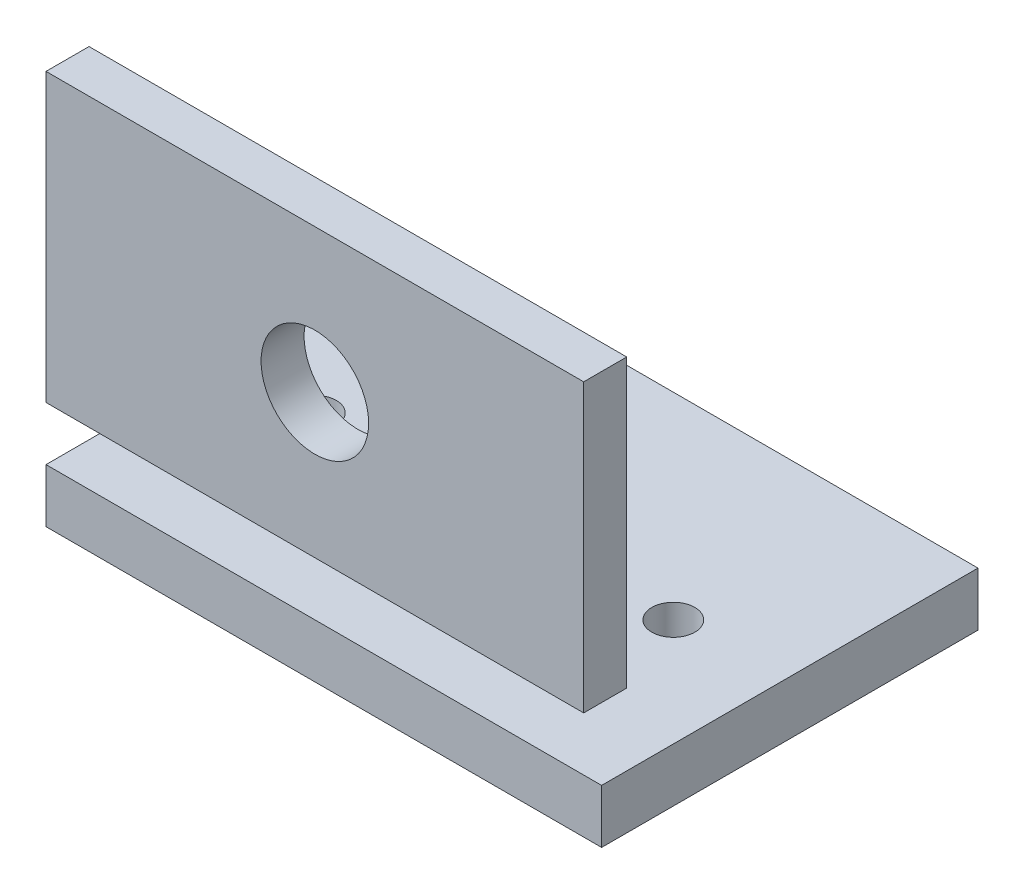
ISO-10303-21;
HEADER;
FILE_DESCRIPTION(('STEP AP214'),'2;1');
FILE_NAME('part.step','',(''),(''),'','','');
FILE_SCHEMA(('AUTOMOTIVE_DESIGN { 1 0 10303 214 1 1 1 1 }'));
ENDSEC;
DATA;
#1=APPLICATION_CONTEXT('core data for automotive mechanical design processes');
#2=APPLICATION_PROTOCOL_DEFINITION('international standard','automotive_design',2000,#1);
#3=PRODUCT_CONTEXT('',#1,'mechanical');
#4=PRODUCT('Part','Part','',(#3));
#5=PRODUCT_RELATED_PRODUCT_CATEGORY('part','',(#4));
#6=PRODUCT_DEFINITION_FORMATION('','',#4);
#7=PRODUCT_DEFINITION_CONTEXT('part definition',#1,'design');
#8=PRODUCT_DEFINITION('design','',#6,#7);
#9=PRODUCT_DEFINITION_SHAPE('','',#8);
#10=(LENGTH_UNIT() NAMED_UNIT(*) SI_UNIT(.MILLI.,.METRE.));
#11=(NAMED_UNIT(*) PLANE_ANGLE_UNIT() SI_UNIT($,.RADIAN.));
#12=(NAMED_UNIT(*) SI_UNIT($,.STERADIAN.) SOLID_ANGLE_UNIT());
#13=UNCERTAINTY_MEASURE_WITH_UNIT(LENGTH_MEASURE(1.E-05),#10,'distance_accuracy_value','');
#14=(GEOMETRIC_REPRESENTATION_CONTEXT(3) GLOBAL_UNCERTAINTY_ASSIGNED_CONTEXT((#13)) GLOBAL_UNIT_ASSIGNED_CONTEXT((#10,
#11,#12)) REPRESENTATION_CONTEXT('',''));
#15=CARTESIAN_POINT('',(0.,0.,0.));
#16=DIRECTION('',(0.,0.,1.));
#17=DIRECTION('',(1.,0.,0.));
#18=AXIS2_PLACEMENT_3D('',#15,#16,#17);
#19=CARTESIAN_POINT('',(0.,15.,-12.));
#20=DIRECTION('',(-1.,0.,0.));
#21=DIRECTION('',(0.,0.,1.));
#22=AXIS2_PLACEMENT_3D('',#19,#20,#21);
#23=PLANE('',#22);
#24=DIRECTION('',(0.,-1.,0.));
#25=VECTOR('',#24,1.);
#26=CARTESIAN_POINT('',(0.,15.,0.));
#27=LINE('',#26,#25);
#28=CARTESIAN_POINT('',(0.,95.,0.));
#29=VERTEX_POINT('',#28);
#30=CARTESIAN_POINT('',(0.,15.,0.));
#31=VERTEX_POINT('',#30);
#32=EDGE_CURVE('E118',#29,#31,#27,.T.);
#33=ORIENTED_EDGE('',*,*,#32,.F.);
#34=DIRECTION('',(0.,0.,1.));
#35=VECTOR('',#34,1.);
#36=CARTESIAN_POINT('',(0.,95.,-12.));
#37=LINE('',#36,#35);
#38=CARTESIAN_POINT('',(0.,95.,-12.));
#39=VERTEX_POINT('',#38);
#40=EDGE_CURVE('E12',#39,#29,#37,.T.);
#41=ORIENTED_EDGE('',*,*,#40,.F.);
#42=DIRECTION('',(0.,-1.,0.));
#43=VECTOR('',#42,1.);
#44=CARTESIAN_POINT('',(0.,15.,-12.));
#45=LINE('',#44,#43);
#46=CARTESIAN_POINT('',(0.,15.,-12.));
#47=VERTEX_POINT('',#46);
#48=EDGE_CURVE('E108',#39,#47,#45,.T.);
#49=ORIENTED_EDGE('',*,*,#48,.T.);
#50=DIRECTION('',(0.,0.,1.));
#51=VECTOR('',#50,1.);
#52=CARTESIAN_POINT('',(0.,15.,-12.));
#53=LINE('',#52,#51);
#54=EDGE_CURVE('E53',#47,#31,#53,.T.);
#55=ORIENTED_EDGE('',*,*,#54,.T.);
#56=EDGE_LOOP('',(#33,#41,#49,#55));
#57=FACE_BOUND('',#56,.T.);
#58=ADVANCED_FACE('F51',(#57),#23,.T.);
#59=CARTESIAN_POINT('',(0.,95.,-12.));
#60=DIRECTION('',(0.,1.,0.));
#61=DIRECTION('',(0.,0.,1.));
#62=AXIS2_PLACEMENT_3D('',#59,#60,#61);
#63=PLANE('',#62);
#64=DIRECTION('',(-1.,0.,0.));
#65=VECTOR('',#64,1.);
#66=CARTESIAN_POINT('',(0.,95.,0.));
#67=LINE('',#66,#65);
#68=CARTESIAN_POINT('',(150.,95.,0.));
#69=VERTEX_POINT('',#68);
#70=EDGE_CURVE('E112',#69,#29,#67,.T.);
#71=ORIENTED_EDGE('',*,*,#70,.F.);
#72=DIRECTION('',(0.,0.,1.));
#73=VECTOR('',#72,1.);
#74=CARTESIAN_POINT('',(150.,95.,-12.));
#75=LINE('',#74,#73);
#76=CARTESIAN_POINT('',(150.,95.,-12.));
#77=VERTEX_POINT('',#76);
#78=EDGE_CURVE('E58',#77,#69,#75,.T.);
#79=ORIENTED_EDGE('',*,*,#78,.F.);
#80=DIRECTION('',(-1.,0.,0.));
#81=VECTOR('',#80,1.);
#82=CARTESIAN_POINT('',(0.,95.,-12.));
#83=LINE('',#82,#81);
#84=EDGE_CURVE('E106',#77,#39,#83,.T.);
#85=ORIENTED_EDGE('',*,*,#84,.T.);
#86=ORIENTED_EDGE('',*,*,#40,.T.);
#87=EDGE_LOOP('',(#71,#79,#85,#86));
#88=FACE_BOUND('',#87,.T.);
#89=ADVANCED_FACE('F130',(#88),#63,.T.);
#90=CARTESIAN_POINT('',(150.,15.,-12.));
#91=DIRECTION('',(1.,0.,0.));
#92=DIRECTION('',(0.,0.,-1.));
#93=AXIS2_PLACEMENT_3D('',#90,#91,#92);
#94=PLANE('',#93);
#95=DIRECTION('',(0.,1.,0.));
#96=VECTOR('',#95,1.);
#97=CARTESIAN_POINT('',(150.,15.,0.));
#98=LINE('',#97,#96);
#99=CARTESIAN_POINT('',(150.,15.,0.));
#100=VERTEX_POINT('',#99);
#101=EDGE_CURVE('E101',#100,#69,#98,.T.);
#102=ORIENTED_EDGE('',*,*,#101,.F.);
#103=DIRECTION('',(0.,0.,1.));
#104=VECTOR('',#103,1.);
#105=CARTESIAN_POINT('',(150.,15.,-12.));
#106=LINE('',#105,#104);
#107=CARTESIAN_POINT('',(150.,15.,-12.));
#108=VERTEX_POINT('',#107);
#109=EDGE_CURVE('E96',#108,#100,#106,.T.);
#110=ORIENTED_EDGE('',*,*,#109,.F.);
#111=DIRECTION('',(0.,1.,0.));
#112=VECTOR('',#111,1.);
#113=CARTESIAN_POINT('',(150.,15.,-12.));
#114=LINE('',#113,#112);
#115=EDGE_CURVE('E97',#108,#77,#114,.T.);
#116=ORIENTED_EDGE('',*,*,#115,.T.);
#117=ORIENTED_EDGE('',*,*,#78,.T.);
#118=EDGE_LOOP('',(#102,#110,#116,#117));
#119=FACE_BOUND('',#118,.T.);
#120=ADVANCED_FACE('F98',(#119),#94,.T.);
#121=CARTESIAN_POINT('',(0.,15.,-12.));
#122=DIRECTION('',(0.,-1.,0.));
#123=DIRECTION('',(0.,0.,-1.));
#124=AXIS2_PLACEMENT_3D('',#121,#122,#123);
#125=PLANE('',#124);
#126=DIRECTION('',(1.,0.,0.));
#127=VECTOR('',#126,1.);
#128=CARTESIAN_POINT('',(0.,15.,0.));
#129=LINE('',#128,#127);
#130=EDGE_CURVE('E119',#31,#100,#129,.T.);
#131=ORIENTED_EDGE('',*,*,#130,.F.);
#132=ORIENTED_EDGE('',*,*,#54,.F.);
#133=DIRECTION('',(1.,0.,0.));
#134=VECTOR('',#133,1.);
#135=CARTESIAN_POINT('',(0.,15.,-12.));
#136=LINE('',#135,#134);
#137=EDGE_CURVE('E104',#47,#108,#136,.T.);
#138=ORIENTED_EDGE('',*,*,#137,.T.);
#139=ORIENTED_EDGE('',*,*,#109,.T.);
#140=EDGE_LOOP('',(#131,#132,#138,#139));
#141=FACE_BOUND('',#140,.T.);
#142=ADVANCED_FACE('F107',(#141),#125,.T.);
#143=CARTESIAN_POINT('',(0.,0.,-12.));
#144=DIRECTION('',(0.,0.,-1.));
#145=DIRECTION('',(-1.,0.,0.));
#146=AXIS2_PLACEMENT_3D('',#143,#144,#145);
#147=PLANE('',#146);
#148=CARTESIAN_POINT('',(75.,55.,-12.));
#149=DIRECTION('',(0.,0.,1.));
#150=DIRECTION('',(1.,0.,0.));
#151=AXIS2_PLACEMENT_3D('',#148,#149,#150);
#152=CIRCLE('',#151,15.);
#153=CARTESIAN_POINT('',(90.,55.,-12.));
#154=VERTEX_POINT('',#153);
#155=EDGE_CURVE('E117',#154,#154,#152,.T.);
#156=ORIENTED_EDGE('',*,*,#155,.T.);
#157=EDGE_LOOP('',(#156));
#158=FACE_BOUND('',#157,.T.);
#159=ORIENTED_EDGE('',*,*,#48,.F.);
#160=ORIENTED_EDGE('',*,*,#84,.F.);
#161=ORIENTED_EDGE('',*,*,#115,.F.);
#162=ORIENTED_EDGE('',*,*,#137,.F.);
#163=EDGE_LOOP('',(#159,#160,#161,#162));
#164=FACE_BOUND('',#163,.T.);
#165=ADVANCED_FACE('F102',(#158,#164),#147,.T.);
#166=CARTESIAN_POINT('',(0.,0.,0.));
#167=DIRECTION('',(0.,0.,-1.));
#168=DIRECTION('',(-1.,0.,0.));
#169=AXIS2_PLACEMENT_3D('',#166,#167,#168);
#170=PLANE('',#169);
#171=CARTESIAN_POINT('',(75.,55.,0.));
#172=DIRECTION('',(0.,0.,1.));
#173=DIRECTION('',(1.,0.,0.));
#174=AXIS2_PLACEMENT_3D('',#171,#172,#173);
#175=CIRCLE('',#174,15.);
#176=CARTESIAN_POINT('',(90.,55.,0.));
#177=VERTEX_POINT('',#176);
#178=EDGE_CURVE('E160',#177,#177,#175,.T.);
#179=ORIENTED_EDGE('',*,*,#178,.F.);
#180=EDGE_LOOP('',(#179));
#181=FACE_BOUND('',#180,.T.);
#182=ORIENTED_EDGE('',*,*,#32,.T.);
#183=ORIENTED_EDGE('',*,*,#130,.T.);
#184=ORIENTED_EDGE('',*,*,#101,.T.);
#185=ORIENTED_EDGE('',*,*,#70,.T.);
#186=EDGE_LOOP('',(#182,#183,#184,#185));
#187=FACE_BOUND('',#186,.T.);
#188=ADVANCED_FACE('F127',(#181,#187),#170,.F.);
#189=CARTESIAN_POINT('',(75.,55.,-12.));
#190=DIRECTION('',(0.,0.,1.));
#191=DIRECTION('',(1.,0.,0.));
#192=AXIS2_PLACEMENT_3D('',#189,#190,#191);
#193=CYLINDRICAL_SURFACE('',#192,15.);
#194=ORIENTED_EDGE('',*,*,#155,.F.);
#195=EDGE_LOOP('',(#194));
#196=FACE_BOUND('',#195,.T.);
#197=ORIENTED_EDGE('',*,*,#178,.T.);
#198=EDGE_LOOP('',(#197));
#199=FACE_BOUND('',#198,.T.);
#200=ADVANCED_FACE('F144',(#196,#199),#193,.F.);
#201=CLOSED_SHELL('',(#58,#89,#120,#142,#165,#188,#200));
#202=MANIFOLD_SOLID_BREP('B2',#201);
#203=CARTESIAN_POINT('',(0.,-15.,0.));
#204=DIRECTION('',(-1.,0.,0.));
#205=DIRECTION('',(0.,0.,1.));
#206=AXIS2_PLACEMENT_3D('',#203,#204,#205);
#207=PLANE('',#206);
#208=DIRECTION('',(0.,0.,1.));
#209=VECTOR('',#208,1.);
#210=CARTESIAN_POINT('',(0.,0.,0.));
#211=LINE('',#210,#209);
#212=CARTESIAN_POINT('',(0.,0.,-105.));
#213=VERTEX_POINT('',#212);
#214=CARTESIAN_POINT('',(0.,0.,0.));
#215=VERTEX_POINT('',#214);
#216=EDGE_CURVE('E261',#213,#215,#211,.T.);
#217=ORIENTED_EDGE('',*,*,#216,.F.);
#218=DIRECTION('',(0.,1.,0.));
#219=VECTOR('',#218,1.);
#220=CARTESIAN_POINT('',(0.,-15.,-105.));
#221=LINE('',#220,#219);
#222=CARTESIAN_POINT('',(0.,-15.,-105.));
#223=VERTEX_POINT('',#222);
#224=EDGE_CURVE('E47',#223,#213,#221,.T.);
#225=ORIENTED_EDGE('',*,*,#224,.F.);
#226=DIRECTION('',(0.,0.,1.));
#227=VECTOR('',#226,1.);
#228=CARTESIAN_POINT('',(0.,-15.,0.));
#229=LINE('',#228,#227);
#230=CARTESIAN_POINT('',(0.,-15.,0.));
#231=VERTEX_POINT('',#230);
#232=EDGE_CURVE('E255',#223,#231,#229,.T.);
#233=ORIENTED_EDGE('',*,*,#232,.T.);
#234=DIRECTION('',(0.,1.,0.));
#235=VECTOR('',#234,1.);
#236=CARTESIAN_POINT('',(0.,-15.,0.));
#237=LINE('',#236,#235);
#238=EDGE_CURVE('E200',#231,#215,#237,.T.);
#239=ORIENTED_EDGE('',*,*,#238,.T.);
#240=EDGE_LOOP('',(#217,#225,#233,#239));
#241=FACE_BOUND('',#240,.T.);
#242=ADVANCED_FACE('F198',(#241),#207,.T.);
#243=CARTESIAN_POINT('',(0.,-15.,-105.));
#244=DIRECTION('',(0.,0.,-1.));
#245=DIRECTION('',(-1.,0.,0.));
#246=AXIS2_PLACEMENT_3D('',#243,#244,#245);
#247=PLANE('',#246);
#248=DIRECTION('',(-1.,0.,0.));
#249=VECTOR('',#248,1.);
#250=CARTESIAN_POINT('',(0.,0.,-105.));
#251=LINE('',#250,#249);
#252=CARTESIAN_POINT('',(155.,0.,-105.));
#253=VERTEX_POINT('',#252);
#254=EDGE_CURVE('E258',#253,#213,#251,.T.);
#255=ORIENTED_EDGE('',*,*,#254,.F.);
#256=DIRECTION('',(0.,1.,0.));
#257=VECTOR('',#256,1.);
#258=CARTESIAN_POINT('',(155.,-15.,-105.));
#259=LINE('',#258,#257);
#260=CARTESIAN_POINT('',(155.,-15.,-105.));
#261=VERTEX_POINT('',#260);
#262=EDGE_CURVE('E202',#261,#253,#259,.T.);
#263=ORIENTED_EDGE('',*,*,#262,.F.);
#264=DIRECTION('',(-1.,0.,0.));
#265=VECTOR('',#264,1.);
#266=CARTESIAN_POINT('',(0.,-15.,-105.));
#267=LINE('',#266,#265);
#268=EDGE_CURVE('E253',#261,#223,#267,.T.);
#269=ORIENTED_EDGE('',*,*,#268,.T.);
#270=ORIENTED_EDGE('',*,*,#224,.T.);
#271=EDGE_LOOP('',(#255,#263,#269,#270));
#272=FACE_BOUND('',#271,.T.);
#273=ADVANCED_FACE('F275',(#272),#247,.T.);
#274=CARTESIAN_POINT('',(155.,-15.,0.));
#275=DIRECTION('',(1.,0.,0.));
#276=DIRECTION('',(0.,0.,-1.));
#277=AXIS2_PLACEMENT_3D('',#274,#275,#276);
#278=PLANE('',#277);
#279=DIRECTION('',(0.,0.,-1.));
#280=VECTOR('',#279,1.);
#281=CARTESIAN_POINT('',(155.,0.,0.));
#282=LINE('',#281,#280);
#283=CARTESIAN_POINT('',(155.,0.,0.));
#284=VERTEX_POINT('',#283);
#285=EDGE_CURVE('E247',#284,#253,#282,.T.);
#286=ORIENTED_EDGE('',*,*,#285,.F.);
#287=DIRECTION('',(0.,1.,0.));
#288=VECTOR('',#287,1.);
#289=CARTESIAN_POINT('',(155.,-15.,0.));
#290=LINE('',#289,#288);
#291=CARTESIAN_POINT('',(155.,-15.,0.));
#292=VERTEX_POINT('',#291);
#293=EDGE_CURVE('E243',#292,#284,#290,.T.);
#294=ORIENTED_EDGE('',*,*,#293,.F.);
#295=DIRECTION('',(0.,0.,-1.));
#296=VECTOR('',#295,1.);
#297=CARTESIAN_POINT('',(155.,-15.,0.));
#298=LINE('',#297,#296);
#299=EDGE_CURVE('E244',#292,#261,#298,.T.);
#300=ORIENTED_EDGE('',*,*,#299,.T.);
#301=ORIENTED_EDGE('',*,*,#262,.T.);
#302=EDGE_LOOP('',(#286,#294,#300,#301));
#303=FACE_BOUND('',#302,.T.);
#304=ADVANCED_FACE('F241',(#303),#278,.T.);
#305=CARTESIAN_POINT('',(0.,-15.,0.));
#306=DIRECTION('',(0.,0.,1.));
#307=DIRECTION('',(1.,0.,0.));
#308=AXIS2_PLACEMENT_3D('',#305,#306,#307);
#309=PLANE('',#308);
#310=DIRECTION('',(1.,0.,0.));
#311=VECTOR('',#310,1.);
#312=CARTESIAN_POINT('',(0.,0.,0.));
#313=LINE('',#312,#311);
#314=EDGE_CURVE('E262',#215,#284,#313,.T.);
#315=ORIENTED_EDGE('',*,*,#314,.F.);
#316=ORIENTED_EDGE('',*,*,#238,.F.);
#317=DIRECTION('',(1.,0.,0.));
#318=VECTOR('',#317,1.);
#319=CARTESIAN_POINT('',(0.,-15.,0.));
#320=LINE('',#319,#318);
#321=EDGE_CURVE('E246',#231,#292,#320,.T.);
#322=ORIENTED_EDGE('',*,*,#321,.T.);
#323=ORIENTED_EDGE('',*,*,#293,.T.);
#324=EDGE_LOOP('',(#315,#316,#322,#323));
#325=FACE_BOUND('',#324,.T.);
#326=ADVANCED_FACE('F251',(#325),#309,.T.);
#327=CARTESIAN_POINT('',(0.,-15.,0.));
#328=DIRECTION('',(0.,-1.,0.));
#329=DIRECTION('',(0.,0.,-1.));
#330=AXIS2_PLACEMENT_3D('',#327,#328,#329);
#331=PLANE('',#330);
#332=CARTESIAN_POINT('',(25.,-15.,-50.));
#333=DIRECTION('',(0.,1.,0.));
#334=DIRECTION('',(0.,0.,1.));
#335=AXIS2_PLACEMENT_3D('',#332,#333,#334);
#336=CIRCLE('',#335,6.);
#337=CARTESIAN_POINT('',(25.,-15.,-44.));
#338=VERTEX_POINT('',#337);
#339=EDGE_CURVE('E264',#338,#338,#336,.T.);
#340=ORIENTED_EDGE('',*,*,#339,.T.);
#341=EDGE_LOOP('',(#340));
#342=FACE_BOUND('',#341,.T.);
#343=CARTESIAN_POINT('',(125.,-15.,-50.));
#344=DIRECTION('',(0.,1.,0.));
#345=DIRECTION('',(0.,0.,1.));
#346=AXIS2_PLACEMENT_3D('',#343,#344,#345);
#347=CIRCLE('',#346,6.00000000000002);
#348=CARTESIAN_POINT('',(125.,-15.,-44.));
#349=VERTEX_POINT('',#348);
#350=EDGE_CURVE('E315',#349,#349,#347,.T.);
#351=ORIENTED_EDGE('',*,*,#350,.T.);
#352=EDGE_LOOP('',(#351));
#353=FACE_BOUND('',#352,.T.);
#354=ORIENTED_EDGE('',*,*,#232,.F.);
#355=ORIENTED_EDGE('',*,*,#268,.F.);
#356=ORIENTED_EDGE('',*,*,#299,.F.);
#357=ORIENTED_EDGE('',*,*,#321,.F.);
#358=EDGE_LOOP('',(#354,#355,#356,#357));
#359=FACE_BOUND('',#358,.T.);
#360=ADVANCED_FACE('F249',(#342,#353,#359),#331,.T.);
#361=CARTESIAN_POINT('',(0.,0.,0.));
#362=DIRECTION('',(0.,-1.,0.));
#363=DIRECTION('',(0.,0.,-1.));
#364=AXIS2_PLACEMENT_3D('',#361,#362,#363);
#365=PLANE('',#364);
#366=CARTESIAN_POINT('',(25.,0.,-50.));
#367=DIRECTION('',(0.,1.,0.));
#368=DIRECTION('',(0.,0.,1.));
#369=AXIS2_PLACEMENT_3D('',#366,#367,#368);
#370=CIRCLE('',#369,6.);
#371=CARTESIAN_POINT('',(25.,0.,-44.));
#372=VERTEX_POINT('',#371);
#373=EDGE_CURVE('E307',#372,#372,#370,.T.);
#374=ORIENTED_EDGE('',*,*,#373,.F.);
#375=EDGE_LOOP('',(#374));
#376=FACE_BOUND('',#375,.T.);
#377=CARTESIAN_POINT('',(125.,0.,-50.));
#378=DIRECTION('',(0.,1.,0.));
#379=DIRECTION('',(0.,0.,1.));
#380=AXIS2_PLACEMENT_3D('',#377,#378,#379);
#381=CIRCLE('',#380,6.00000000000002);
#382=CARTESIAN_POINT('',(125.,0.,-44.));
#383=VERTEX_POINT('',#382);
#384=EDGE_CURVE('E306',#383,#383,#381,.T.);
#385=ORIENTED_EDGE('',*,*,#384,.F.);
#386=EDGE_LOOP('',(#385));
#387=FACE_BOUND('',#386,.T.);
#388=ORIENTED_EDGE('',*,*,#216,.T.);
#389=ORIENTED_EDGE('',*,*,#314,.T.);
#390=ORIENTED_EDGE('',*,*,#285,.T.);
#391=ORIENTED_EDGE('',*,*,#254,.T.);
#392=EDGE_LOOP('',(#388,#389,#390,#391));
#393=FACE_BOUND('',#392,.T.);
#394=ADVANCED_FACE('F271',(#376,#387,#393),#365,.F.);
#395=CARTESIAN_POINT('',(125.,-15.,-50.));
#396=DIRECTION('',(0.,1.,0.));
#397=DIRECTION('',(0.,0.,1.));
#398=AXIS2_PLACEMENT_3D('',#395,#396,#397);
#399=CYLINDRICAL_SURFACE('',#398,6.00000000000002);
#400=ORIENTED_EDGE('',*,*,#350,.F.);
#401=EDGE_LOOP('',(#400));
#402=FACE_BOUND('',#401,.T.);
#403=ORIENTED_EDGE('',*,*,#384,.T.);
#404=EDGE_LOOP('',(#403));
#405=FACE_BOUND('',#404,.T.);
#406=ADVANCED_FACE('F286',(#402,#405),#399,.F.);
#407=CARTESIAN_POINT('',(25.,-15.,-50.));
#408=DIRECTION('',(0.,1.,0.));
#409=DIRECTION('',(0.,0.,1.));
#410=AXIS2_PLACEMENT_3D('',#407,#408,#409);
#411=CYLINDRICAL_SURFACE('',#410,6.);
#412=ORIENTED_EDGE('',*,*,#339,.F.);
#413=EDGE_LOOP('',(#412));
#414=FACE_BOUND('',#413,.T.);
#415=ORIENTED_EDGE('',*,*,#373,.T.);
#416=EDGE_LOOP('',(#415));
#417=FACE_BOUND('',#416,.T.);
#418=ADVANCED_FACE('F300',(#414,#417),#411,.F.);
#419=CLOSED_SHELL('',(#242,#273,#304,#326,#360,#394,#406,#418));
#420=MANIFOLD_SOLID_BREP('B6',#419);
#421=ADVANCED_BREP_SHAPE_REPRESENTATION('',(#18,#202,#420),#14);
#422=SHAPE_DEFINITION_REPRESENTATION(#9,#421);
ENDSEC;
END-ISO-10303-21;
